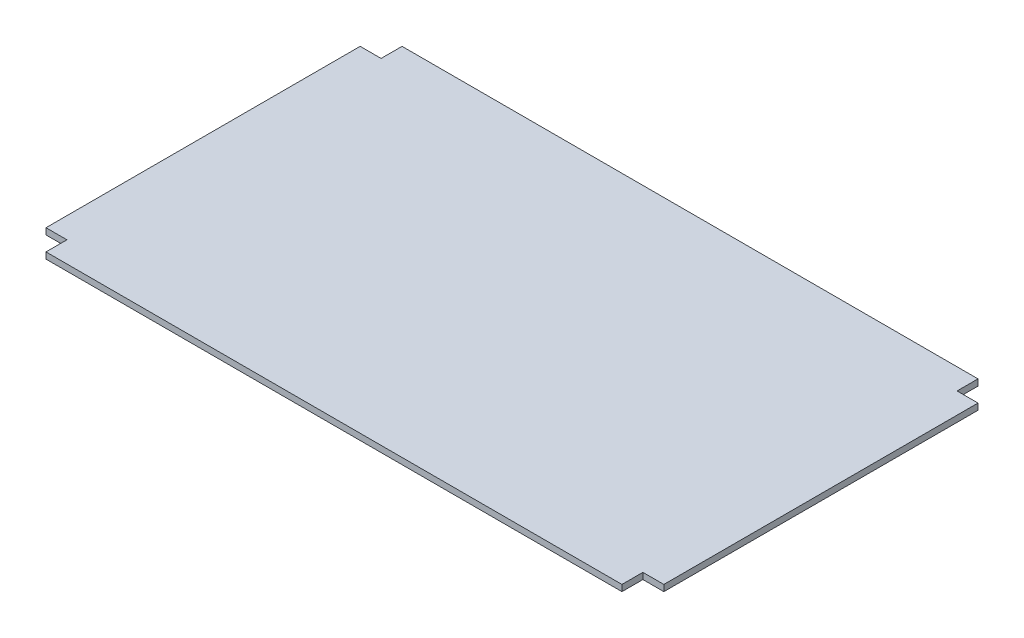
ISO-10303-21;
HEADER;
FILE_DESCRIPTION(('STEP AP214'),'2;1');
FILE_NAME('part.step','',(''),(''),'','','');
FILE_SCHEMA(('AUTOMOTIVE_DESIGN { 1 0 10303 214 1 1 1 1 }'));
ENDSEC;
DATA;
#1=APPLICATION_CONTEXT('core data for automotive mechanical design processes');
#2=APPLICATION_PROTOCOL_DEFINITION('international standard','automotive_design',2000,#1);
#3=PRODUCT_CONTEXT('',#1,'mechanical');
#4=PRODUCT('Part','Part','',(#3));
#5=PRODUCT_RELATED_PRODUCT_CATEGORY('part','',(#4));
#6=PRODUCT_DEFINITION_FORMATION('','',#4);
#7=PRODUCT_DEFINITION_CONTEXT('part definition',#1,'design');
#8=PRODUCT_DEFINITION('design','',#6,#7);
#9=PRODUCT_DEFINITION_SHAPE('','',#8);
#10=(LENGTH_UNIT() NAMED_UNIT(*) SI_UNIT(.MILLI.,.METRE.));
#11=(NAMED_UNIT(*) PLANE_ANGLE_UNIT() SI_UNIT($,.RADIAN.));
#12=(NAMED_UNIT(*) SI_UNIT($,.STERADIAN.) SOLID_ANGLE_UNIT());
#13=UNCERTAINTY_MEASURE_WITH_UNIT(LENGTH_MEASURE(1.E-05),#10,'distance_accuracy_value','');
#14=(GEOMETRIC_REPRESENTATION_CONTEXT(3) GLOBAL_UNCERTAINTY_ASSIGNED_CONTEXT((#13)) GLOBAL_UNIT_ASSIGNED_CONTEXT((#10,
#11,#12)) REPRESENTATION_CONTEXT('',''));
#15=CARTESIAN_POINT('',(0.,0.,0.));
#16=DIRECTION('',(0.,0.,1.));
#17=DIRECTION('',(1.,0.,0.));
#18=AXIS2_PLACEMENT_3D('',#15,#16,#17);
#19=CARTESIAN_POINT('',(550.,6.,340.));
#20=DIRECTION('',(-1.,0.,0.));
#21=DIRECTION('',(0.,0.,1.));
#22=AXIS2_PLACEMENT_3D('',#19,#20,#21);
#23=PLANE('',#22);
#24=DIRECTION('',(0.,0.,-1.));
#25=VECTOR('',#24,1.);
#26=CARTESIAN_POINT('',(550.,-6.,340.));
#27=LINE('',#26,#25);
#28=CARTESIAN_POINT('',(550.,-6.,340.));
#29=VERTEX_POINT('',#28);
#30=CARTESIAN_POINT('',(550.,-6.,300.));
#31=VERTEX_POINT('',#30);
#32=EDGE_CURVE('E156',#29,#31,#27,.T.);
#33=ORIENTED_EDGE('',*,*,#32,.T.);
#34=DIRECTION('',(0.,-1.,0.));
#35=VECTOR('',#34,1.);
#36=CARTESIAN_POINT('',(550.,6.,300.));
#37=LINE('',#36,#35);
#38=CARTESIAN_POINT('',(550.,6.,300.));
#39=VERTEX_POINT('',#38);
#40=EDGE_CURVE('E11',#39,#31,#37,.T.);
#41=ORIENTED_EDGE('',*,*,#40,.F.);
#42=DIRECTION('',(0.,0.,-1.));
#43=VECTOR('',#42,1.);
#44=CARTESIAN_POINT('',(550.,6.,340.));
#45=LINE('',#44,#43);
#46=CARTESIAN_POINT('',(550.,6.,340.));
#47=VERTEX_POINT('',#46);
#48=EDGE_CURVE('E178',#47,#39,#45,.T.);
#49=ORIENTED_EDGE('',*,*,#48,.F.);
#50=DIRECTION('',(0.,-1.,0.));
#51=VECTOR('',#50,1.);
#52=CARTESIAN_POINT('',(550.,6.,340.));
#53=LINE('',#52,#51);
#54=EDGE_CURVE('E152',#47,#29,#53,.T.);
#55=ORIENTED_EDGE('',*,*,#54,.T.);
#56=EDGE_LOOP('',(#33,#41,#49,#55));
#57=FACE_BOUND('',#56,.T.);
#58=ADVANCED_FACE('F36',(#57),#23,.F.);
#59=CARTESIAN_POINT('',(590.,6.,300.));
#60=DIRECTION('',(0.,0.,-1.));
#61=DIRECTION('',(-1.,0.,0.));
#62=AXIS2_PLACEMENT_3D('',#59,#60,#61);
#63=PLANE('',#62);
#64=DIRECTION('',(1.,0.,0.));
#65=VECTOR('',#64,1.);
#66=CARTESIAN_POINT('',(590.,-6.,300.));
#67=LINE('',#66,#65);
#68=CARTESIAN_POINT('',(590.,-6.,300.));
#69=VERTEX_POINT('',#68);
#70=EDGE_CURVE('E159',#31,#69,#67,.T.);
#71=ORIENTED_EDGE('',*,*,#70,.T.);
#72=DIRECTION('',(0.,-1.,0.));
#73=VECTOR('',#72,1.);
#74=CARTESIAN_POINT('',(590.,6.,300.));
#75=LINE('',#74,#73);
#76=CARTESIAN_POINT('',(590.,6.,300.));
#77=VERTEX_POINT('',#76);
#78=EDGE_CURVE('E44',#77,#69,#75,.T.);
#79=ORIENTED_EDGE('',*,*,#78,.F.);
#80=DIRECTION('',(1.,0.,0.));
#81=VECTOR('',#80,1.);
#82=CARTESIAN_POINT('',(590.,6.,300.));
#83=LINE('',#82,#81);
#84=EDGE_CURVE('E107',#39,#77,#83,.T.);
#85=ORIENTED_EDGE('',*,*,#84,.F.);
#86=ORIENTED_EDGE('',*,*,#40,.T.);
#87=EDGE_LOOP('',(#71,#79,#85,#86));
#88=FACE_BOUND('',#87,.T.);
#89=ADVANCED_FACE('F256',(#88),#63,.F.);
#90=CARTESIAN_POINT('',(590.,6.,300.));
#91=DIRECTION('',(-1.,0.,0.));
#92=DIRECTION('',(0.,0.,1.));
#93=AXIS2_PLACEMENT_3D('',#90,#91,#92);
#94=PLANE('',#93);
#95=DIRECTION('',(0.,0.,-1.));
#96=VECTOR('',#95,1.);
#97=CARTESIAN_POINT('',(590.,-6.,300.));
#98=LINE('',#97,#96);
#99=CARTESIAN_POINT('',(590.,-6.,-300.));
#100=VERTEX_POINT('',#99);
#101=EDGE_CURVE('E161',#69,#100,#98,.T.);
#102=ORIENTED_EDGE('',*,*,#101,.T.);
#103=DIRECTION('',(0.,-1.,0.));
#104=VECTOR('',#103,1.);
#105=CARTESIAN_POINT('',(590.,6.,-300.));
#106=LINE('',#105,#104);
#107=CARTESIAN_POINT('',(590.,6.,-300.));
#108=VERTEX_POINT('',#107);
#109=EDGE_CURVE('E197',#108,#100,#106,.T.);
#110=ORIENTED_EDGE('',*,*,#109,.F.);
#111=DIRECTION('',(0.,0.,-1.));
#112=VECTOR('',#111,1.);
#113=CARTESIAN_POINT('',(590.,6.,300.));
#114=LINE('',#113,#112);
#115=EDGE_CURVE('E205',#77,#108,#114,.T.);
#116=ORIENTED_EDGE('',*,*,#115,.F.);
#117=ORIENTED_EDGE('',*,*,#78,.T.);
#118=EDGE_LOOP('',(#102,#110,#116,#117));
#119=FACE_BOUND('',#118,.T.);
#120=ADVANCED_FACE('F203',(#119),#94,.F.);
#121=CARTESIAN_POINT('',(590.,6.,-300.));
#122=DIRECTION('',(0.,0.,1.));
#123=DIRECTION('',(1.,0.,0.));
#124=AXIS2_PLACEMENT_3D('',#121,#122,#123);
#125=PLANE('',#124);
#126=DIRECTION('',(-1.,0.,0.));
#127=VECTOR('',#126,1.);
#128=CARTESIAN_POINT('',(590.,-6.,-300.));
#129=LINE('',#128,#127);
#130=CARTESIAN_POINT('',(550.,-6.,-300.));
#131=VERTEX_POINT('',#130);
#132=EDGE_CURVE('E163',#100,#131,#129,.T.);
#133=ORIENTED_EDGE('',*,*,#132,.T.);
#134=DIRECTION('',(0.,-1.,0.));
#135=VECTOR('',#134,1.);
#136=CARTESIAN_POINT('',(550.,6.,-300.));
#137=LINE('',#136,#135);
#138=CARTESIAN_POINT('',(550.,6.,-300.));
#139=VERTEX_POINT('',#138);
#140=EDGE_CURVE('E194',#139,#131,#137,.T.);
#141=ORIENTED_EDGE('',*,*,#140,.F.);
#142=DIRECTION('',(-1.,0.,0.));
#143=VECTOR('',#142,1.);
#144=CARTESIAN_POINT('',(590.,6.,-300.));
#145=LINE('',#144,#143);
#146=EDGE_CURVE('E223',#108,#139,#145,.T.);
#147=ORIENTED_EDGE('',*,*,#146,.F.);
#148=ORIENTED_EDGE('',*,*,#109,.T.);
#149=EDGE_LOOP('',(#133,#141,#147,#148));
#150=FACE_BOUND('',#149,.T.);
#151=ADVANCED_FACE('F214',(#150),#125,.F.);
#152=CARTESIAN_POINT('',(550.,6.,-340.));
#153=DIRECTION('',(-1.,0.,0.));
#154=DIRECTION('',(0.,0.,1.));
#155=AXIS2_PLACEMENT_3D('',#152,#153,#154);
#156=PLANE('',#155);
#157=DIRECTION('',(0.,0.,-1.));
#158=VECTOR('',#157,1.);
#159=CARTESIAN_POINT('',(550.,-6.,-340.));
#160=LINE('',#159,#158);
#161=CARTESIAN_POINT('',(550.,-6.,-340.));
#162=VERTEX_POINT('',#161);
#163=EDGE_CURVE('E165',#131,#162,#160,.T.);
#164=ORIENTED_EDGE('',*,*,#163,.T.);
#165=DIRECTION('',(0.,-1.,0.));
#166=VECTOR('',#165,1.);
#167=CARTESIAN_POINT('',(550.,6.,-340.));
#168=LINE('',#167,#166);
#169=CARTESIAN_POINT('',(550.,6.,-340.));
#170=VERTEX_POINT('',#169);
#171=EDGE_CURVE('E191',#170,#162,#168,.T.);
#172=ORIENTED_EDGE('',*,*,#171,.F.);
#173=DIRECTION('',(0.,0.,-1.));
#174=VECTOR('',#173,1.);
#175=CARTESIAN_POINT('',(550.,6.,-340.));
#176=LINE('',#175,#174);
#177=EDGE_CURVE('E220',#139,#170,#176,.T.);
#178=ORIENTED_EDGE('',*,*,#177,.F.);
#179=ORIENTED_EDGE('',*,*,#140,.T.);
#180=EDGE_LOOP('',(#164,#172,#178,#179));
#181=FACE_BOUND('',#180,.T.);
#182=ADVANCED_FACE('F218',(#181),#156,.F.);
#183=CARTESIAN_POINT('',(-550.,6.,-340.));
#184=DIRECTION('',(0.,0.,1.));
#185=DIRECTION('',(1.,0.,0.));
#186=AXIS2_PLACEMENT_3D('',#183,#184,#185);
#187=PLANE('',#186);
#188=DIRECTION('',(-1.,0.,0.));
#189=VECTOR('',#188,1.);
#190=CARTESIAN_POINT('',(-550.,-6.,-340.));
#191=LINE('',#190,#189);
#192=CARTESIAN_POINT('',(-550.,-6.,-340.));
#193=VERTEX_POINT('',#192);
#194=EDGE_CURVE('E167',#162,#193,#191,.T.);
#195=ORIENTED_EDGE('',*,*,#194,.T.);
#196=DIRECTION('',(0.,-1.,0.));
#197=VECTOR('',#196,1.);
#198=CARTESIAN_POINT('',(-550.,6.,-340.));
#199=LINE('',#198,#197);
#200=CARTESIAN_POINT('',(-550.,6.,-340.));
#201=VERTEX_POINT('',#200);
#202=EDGE_CURVE('E188',#201,#193,#199,.T.);
#203=ORIENTED_EDGE('',*,*,#202,.F.);
#204=DIRECTION('',(-1.,0.,0.));
#205=VECTOR('',#204,1.);
#206=CARTESIAN_POINT('',(-550.,6.,-340.));
#207=LINE('',#206,#205);
#208=EDGE_CURVE('E222',#170,#201,#207,.T.);
#209=ORIENTED_EDGE('',*,*,#208,.F.);
#210=ORIENTED_EDGE('',*,*,#171,.T.);
#211=EDGE_LOOP('',(#195,#203,#209,#210));
#212=FACE_BOUND('',#211,.T.);
#213=ADVANCED_FACE('F269',(#212),#187,.F.);
#214=CARTESIAN_POINT('',(-550.,6.,-340.));
#215=DIRECTION('',(1.,0.,0.));
#216=DIRECTION('',(0.,0.,-1.));
#217=AXIS2_PLACEMENT_3D('',#214,#215,#216);
#218=PLANE('',#217);
#219=DIRECTION('',(0.,0.,1.));
#220=VECTOR('',#219,1.);
#221=CARTESIAN_POINT('',(-550.,-6.,-340.));
#222=LINE('',#221,#220);
#223=CARTESIAN_POINT('',(-550.,-6.,-300.));
#224=VERTEX_POINT('',#223);
#225=EDGE_CURVE('E169',#193,#224,#222,.T.);
#226=ORIENTED_EDGE('',*,*,#225,.T.);
#227=DIRECTION('',(0.,-1.,0.));
#228=VECTOR('',#227,1.);
#229=CARTESIAN_POINT('',(-550.,6.,-300.));
#230=LINE('',#229,#228);
#231=CARTESIAN_POINT('',(-550.,6.,-300.));
#232=VERTEX_POINT('',#231);
#233=EDGE_CURVE('E185',#232,#224,#230,.T.);
#234=ORIENTED_EDGE('',*,*,#233,.F.);
#235=DIRECTION('',(0.,0.,1.));
#236=VECTOR('',#235,1.);
#237=CARTESIAN_POINT('',(-550.,6.,-340.));
#238=LINE('',#237,#236);
#239=EDGE_CURVE('E225',#201,#232,#238,.T.);
#240=ORIENTED_EDGE('',*,*,#239,.F.);
#241=ORIENTED_EDGE('',*,*,#202,.T.);
#242=EDGE_LOOP('',(#226,#234,#240,#241));
#243=FACE_BOUND('',#242,.T.);
#244=ADVANCED_FACE('F272',(#243),#218,.F.);
#245=CARTESIAN_POINT('',(-590.,6.,-300.));
#246=DIRECTION('',(0.,0.,1.));
#247=DIRECTION('',(1.,0.,0.));
#248=AXIS2_PLACEMENT_3D('',#245,#246,#247);
#249=PLANE('',#248);
#250=DIRECTION('',(-1.,0.,0.));
#251=VECTOR('',#250,1.);
#252=CARTESIAN_POINT('',(-590.,-6.,-300.));
#253=LINE('',#252,#251);
#254=CARTESIAN_POINT('',(-590.,-6.,-300.));
#255=VERTEX_POINT('',#254);
#256=EDGE_CURVE('E171',#224,#255,#253,.T.);
#257=ORIENTED_EDGE('',*,*,#256,.T.);
#258=DIRECTION('',(0.,-1.,0.));
#259=VECTOR('',#258,1.);
#260=CARTESIAN_POINT('',(-590.,6.,-300.));
#261=LINE('',#260,#259);
#262=CARTESIAN_POINT('',(-590.,6.,-300.));
#263=VERTEX_POINT('',#262);
#264=EDGE_CURVE('E182',#263,#255,#261,.T.);
#265=ORIENTED_EDGE('',*,*,#264,.F.);
#266=DIRECTION('',(-1.,0.,0.));
#267=VECTOR('',#266,1.);
#268=CARTESIAN_POINT('',(-590.,6.,-300.));
#269=LINE('',#268,#267);
#270=EDGE_CURVE('E231',#232,#263,#269,.T.);
#271=ORIENTED_EDGE('',*,*,#270,.F.);
#272=ORIENTED_EDGE('',*,*,#233,.T.);
#273=EDGE_LOOP('',(#257,#265,#271,#272));
#274=FACE_BOUND('',#273,.T.);
#275=ADVANCED_FACE('F237',(#274),#249,.F.);
#276=CARTESIAN_POINT('',(-590.,6.,300.));
#277=DIRECTION('',(1.,0.,0.));
#278=DIRECTION('',(0.,0.,-1.));
#279=AXIS2_PLACEMENT_3D('',#276,#277,#278);
#280=PLANE('',#279);
#281=DIRECTION('',(0.,0.,1.));
#282=VECTOR('',#281,1.);
#283=CARTESIAN_POINT('',(-590.,-6.,300.));
#284=LINE('',#283,#282);
#285=CARTESIAN_POINT('',(-590.,-6.,300.));
#286=VERTEX_POINT('',#285);
#287=EDGE_CURVE('E173',#255,#286,#284,.T.);
#288=ORIENTED_EDGE('',*,*,#287,.T.);
#289=DIRECTION('',(0.,-1.,0.));
#290=VECTOR('',#289,1.);
#291=CARTESIAN_POINT('',(-590.,6.,300.));
#292=LINE('',#291,#290);
#293=CARTESIAN_POINT('',(-590.,6.,300.));
#294=VERTEX_POINT('',#293);
#295=EDGE_CURVE('E147',#294,#286,#292,.T.);
#296=ORIENTED_EDGE('',*,*,#295,.F.);
#297=DIRECTION('',(0.,0.,1.));
#298=VECTOR('',#297,1.);
#299=CARTESIAN_POINT('',(-590.,6.,300.));
#300=LINE('',#299,#298);
#301=EDGE_CURVE('E138',#263,#294,#300,.T.);
#302=ORIENTED_EDGE('',*,*,#301,.F.);
#303=ORIENTED_EDGE('',*,*,#264,.T.);
#304=EDGE_LOOP('',(#288,#296,#302,#303));
#305=FACE_BOUND('',#304,.T.);
#306=ADVANCED_FACE('F241',(#305),#280,.F.);
#307=CARTESIAN_POINT('',(-590.,6.,300.));
#308=DIRECTION('',(0.,0.,-1.));
#309=DIRECTION('',(-1.,0.,0.));
#310=AXIS2_PLACEMENT_3D('',#307,#308,#309);
#311=PLANE('',#310);
#312=DIRECTION('',(1.,0.,0.));
#313=VECTOR('',#312,1.);
#314=CARTESIAN_POINT('',(-590.,-6.,300.));
#315=LINE('',#314,#313);
#316=CARTESIAN_POINT('',(-550.,-6.,300.));
#317=VERTEX_POINT('',#316);
#318=EDGE_CURVE('E146',#286,#317,#315,.T.);
#319=ORIENTED_EDGE('',*,*,#318,.T.);
#320=DIRECTION('',(0.,-1.,0.));
#321=VECTOR('',#320,1.);
#322=CARTESIAN_POINT('',(-550.,6.,300.));
#323=LINE('',#322,#321);
#324=CARTESIAN_POINT('',(-550.,6.,300.));
#325=VERTEX_POINT('',#324);
#326=EDGE_CURVE('E143',#325,#317,#323,.T.);
#327=ORIENTED_EDGE('',*,*,#326,.F.);
#328=DIRECTION('',(1.,0.,0.));
#329=VECTOR('',#328,1.);
#330=CARTESIAN_POINT('',(-590.,6.,300.));
#331=LINE('',#330,#329);
#332=EDGE_CURVE('E132',#294,#325,#331,.T.);
#333=ORIENTED_EDGE('',*,*,#332,.F.);
#334=ORIENTED_EDGE('',*,*,#295,.T.);
#335=EDGE_LOOP('',(#319,#327,#333,#334));
#336=FACE_BOUND('',#335,.T.);
#337=ADVANCED_FACE('F144',(#336),#311,.F.);
#338=CARTESIAN_POINT('',(-550.,6.,340.));
#339=DIRECTION('',(1.,0.,0.));
#340=DIRECTION('',(0.,0.,-1.));
#341=AXIS2_PLACEMENT_3D('',#338,#339,#340);
#342=PLANE('',#341);
#343=DIRECTION('',(0.,0.,1.));
#344=VECTOR('',#343,1.);
#345=CARTESIAN_POINT('',(-550.,-6.,340.));
#346=LINE('',#345,#344);
#347=CARTESIAN_POINT('',(-550.,-6.,340.));
#348=VERTEX_POINT('',#347);
#349=EDGE_CURVE('E93',#317,#348,#346,.T.);
#350=ORIENTED_EDGE('',*,*,#349,.T.);
#351=DIRECTION('',(0.,-1.,0.));
#352=VECTOR('',#351,1.);
#353=CARTESIAN_POINT('',(-550.,6.,340.));
#354=LINE('',#353,#352);
#355=CARTESIAN_POINT('',(-550.,6.,340.));
#356=VERTEX_POINT('',#355);
#357=EDGE_CURVE('E148',#356,#348,#354,.T.);
#358=ORIENTED_EDGE('',*,*,#357,.F.);
#359=DIRECTION('',(0.,0.,1.));
#360=VECTOR('',#359,1.);
#361=CARTESIAN_POINT('',(-550.,6.,340.));
#362=LINE('',#361,#360);
#363=EDGE_CURVE('E136',#325,#356,#362,.T.);
#364=ORIENTED_EDGE('',*,*,#363,.F.);
#365=ORIENTED_EDGE('',*,*,#326,.T.);
#366=EDGE_LOOP('',(#350,#358,#364,#365));
#367=FACE_BOUND('',#366,.T.);
#368=ADVANCED_FACE('F150',(#367),#342,.F.);
#369=CARTESIAN_POINT('',(-550.,6.,340.));
#370=DIRECTION('',(0.,0.,-1.));
#371=DIRECTION('',(-1.,0.,0.));
#372=AXIS2_PLACEMENT_3D('',#369,#370,#371);
#373=PLANE('',#372);
#374=DIRECTION('',(1.,0.,0.));
#375=VECTOR('',#374,1.);
#376=CARTESIAN_POINT('',(-550.,-6.,340.));
#377=LINE('',#376,#375);
#378=EDGE_CURVE('E99',#348,#29,#377,.T.);
#379=ORIENTED_EDGE('',*,*,#378,.T.);
#380=ORIENTED_EDGE('',*,*,#54,.F.);
#381=DIRECTION('',(1.,0.,0.));
#382=VECTOR('',#381,1.);
#383=CARTESIAN_POINT('',(-550.,6.,340.));
#384=LINE('',#383,#382);
#385=EDGE_CURVE('E52',#356,#47,#384,.T.);
#386=ORIENTED_EDGE('',*,*,#385,.F.);
#387=ORIENTED_EDGE('',*,*,#357,.T.);
#388=EDGE_LOOP('',(#379,#380,#386,#387));
#389=FACE_BOUND('',#388,.T.);
#390=ADVANCED_FACE('F245',(#389),#373,.F.);
#391=CARTESIAN_POINT('',(0.,6.,0.));
#392=DIRECTION('',(0.,1.,0.));
#393=DIRECTION('',(0.,0.,1.));
#394=AXIS2_PLACEMENT_3D('',#391,#392,#393);
#395=PLANE('',#394);
#396=ORIENTED_EDGE('',*,*,#48,.T.);
#397=ORIENTED_EDGE('',*,*,#84,.T.);
#398=ORIENTED_EDGE('',*,*,#115,.T.);
#399=ORIENTED_EDGE('',*,*,#146,.T.);
#400=ORIENTED_EDGE('',*,*,#177,.T.);
#401=ORIENTED_EDGE('',*,*,#208,.T.);
#402=ORIENTED_EDGE('',*,*,#239,.T.);
#403=ORIENTED_EDGE('',*,*,#270,.T.);
#404=ORIENTED_EDGE('',*,*,#301,.T.);
#405=ORIENTED_EDGE('',*,*,#332,.T.);
#406=ORIENTED_EDGE('',*,*,#363,.T.);
#407=ORIENTED_EDGE('',*,*,#385,.T.);
#408=EDGE_LOOP('',(#396,#397,#398,#399,#400,#401,#402,#403,#404,#405,#406,#407));
#409=FACE_BOUND('',#408,.T.);
#410=ADVANCED_FACE('F134',(#409),#395,.T.);
#411=CARTESIAN_POINT('',(0.,-6.,0.));
#412=DIRECTION('',(0.,1.,0.));
#413=DIRECTION('',(0.,0.,1.));
#414=AXIS2_PLACEMENT_3D('',#411,#412,#413);
#415=PLANE('',#414);
#416=ORIENTED_EDGE('',*,*,#32,.F.);
#417=ORIENTED_EDGE('',*,*,#378,.F.);
#418=ORIENTED_EDGE('',*,*,#349,.F.);
#419=ORIENTED_EDGE('',*,*,#318,.F.);
#420=ORIENTED_EDGE('',*,*,#287,.F.);
#421=ORIENTED_EDGE('',*,*,#256,.F.);
#422=ORIENTED_EDGE('',*,*,#225,.F.);
#423=ORIENTED_EDGE('',*,*,#194,.F.);
#424=ORIENTED_EDGE('',*,*,#163,.F.);
#425=ORIENTED_EDGE('',*,*,#132,.F.);
#426=ORIENTED_EDGE('',*,*,#101,.F.);
#427=ORIENTED_EDGE('',*,*,#70,.F.);
#428=EDGE_LOOP('',(#416,#417,#418,#419,#420,#421,#422,#423,#424,#425,#426,#427));
#429=FACE_BOUND('',#428,.T.);
#430=ADVANCED_FACE('F209',(#429),#415,.F.);
#431=CLOSED_SHELL('',(#58,#89,#120,#151,#182,#213,#244,#275,#306,#337,#368,#390,#410,#430));
#432=MANIFOLD_SOLID_BREP('B2',#431);
#433=ADVANCED_BREP_SHAPE_REPRESENTATION('',(#18,#432),#14);
#434=SHAPE_DEFINITION_REPRESENTATION(#9,#433);
ENDSEC;
END-ISO-10303-21;
